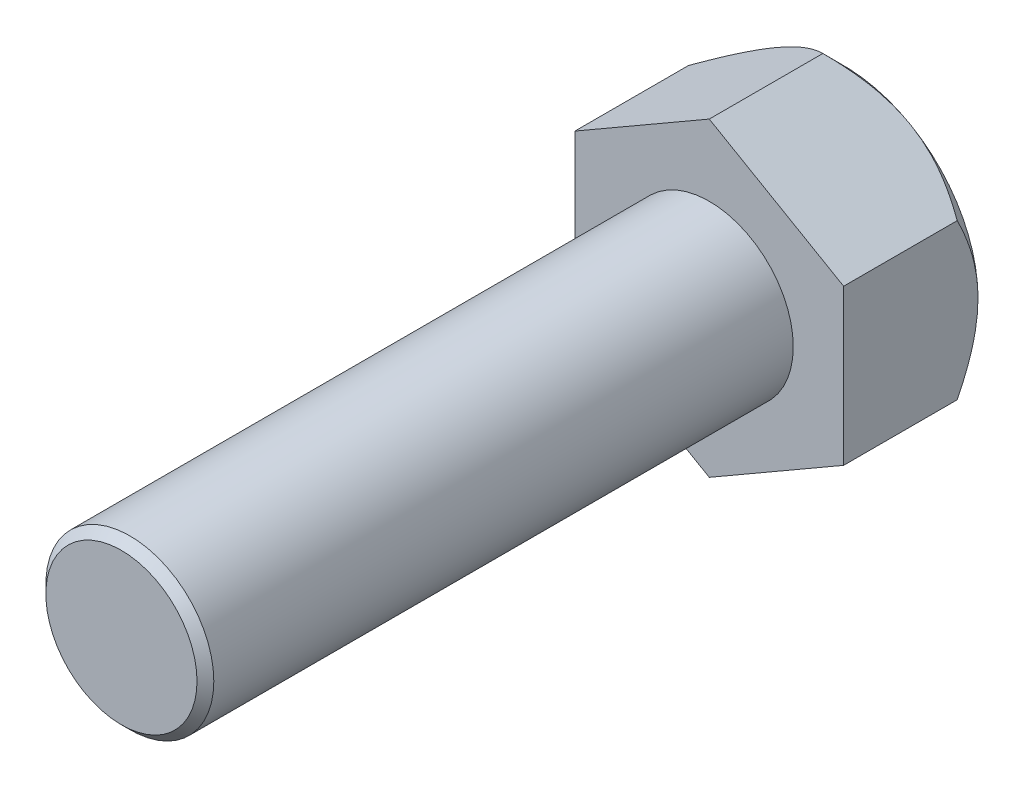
ISO-10303-21;
HEADER;
FILE_DESCRIPTION(('STEP AP214'),'2;1');
FILE_NAME('part.step','',(''),(''),'','','');
FILE_SCHEMA(('AUTOMOTIVE_DESIGN { 1 0 10303 214 1 1 1 1 }'));
ENDSEC;
DATA;
#1=APPLICATION_CONTEXT('core data for automotive mechanical design processes');
#2=APPLICATION_PROTOCOL_DEFINITION('international standard','automotive_design',2000,#1);
#3=PRODUCT_CONTEXT('',#1,'mechanical');
#4=PRODUCT('Part','Part','',(#3));
#5=PRODUCT_RELATED_PRODUCT_CATEGORY('part','',(#4));
#6=PRODUCT_DEFINITION_FORMATION('','',#4);
#7=PRODUCT_DEFINITION_CONTEXT('part definition',#1,'design');
#8=PRODUCT_DEFINITION('design','',#6,#7);
#9=PRODUCT_DEFINITION_SHAPE('','',#8);
#10=(LENGTH_UNIT() NAMED_UNIT(*) SI_UNIT(.MILLI.,.METRE.));
#11=(NAMED_UNIT(*) PLANE_ANGLE_UNIT() SI_UNIT($,.RADIAN.));
#12=(NAMED_UNIT(*) SI_UNIT($,.STERADIAN.) SOLID_ANGLE_UNIT());
#13=UNCERTAINTY_MEASURE_WITH_UNIT(LENGTH_MEASURE(1.E-05),#10,'distance_accuracy_value','');
#14=(GEOMETRIC_REPRESENTATION_CONTEXT(3) GLOBAL_UNCERTAINTY_ASSIGNED_CONTEXT((#13)) GLOBAL_UNIT_ASSIGNED_CONTEXT((#10,
#11,#12)) REPRESENTATION_CONTEXT('',''));
#15=CARTESIAN_POINT('',(0.,0.,0.));
#16=DIRECTION('',(0.,0.,1.));
#17=DIRECTION('',(1.,0.,0.));
#18=AXIS2_PLACEMENT_3D('',#15,#16,#17);
#19=CARTESIAN_POINT('',(0.,9.23760430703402,-8.));
#20=DIRECTION('',(-0.5,-0.866025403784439,0.));
#21=DIRECTION('',(0.866025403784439,-0.5,0.));
#22=AXIS2_PLACEMENT_3D('',#19,#20,#21);
#23=PLANE('',#22);
#24=CARTESIAN_POINT('',(-0.000200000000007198,9.23771977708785,-6.76228022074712));
#25=CARTESIAN_POINT('',(0.137352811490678,9.15830362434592,-6.84168743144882));
#26=CARTESIAN_POINT('',(0.2759629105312,9.07827704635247,-6.91865771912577));
#27=CARTESIAN_POINT('',(0.555505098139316,8.91688328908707,-7.06698316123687));
#28=CARTESIAN_POINT('',(0.696438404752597,8.83551540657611,-7.13833524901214));
#29=CARTESIAN_POINT('',(1.12434348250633,8.58846429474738,-7.3434607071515));
#30=CARTESIAN_POINT('',(1.41493761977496,8.42068969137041,-7.46742824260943));
#31=CARTESIAN_POINT('',(2.00094388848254,8.08235881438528,-7.6797139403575));
#32=CARTESIAN_POINT('',(2.29620625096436,7.91188900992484,-7.76856690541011));
#33=CARTESIAN_POINT('',(2.74395385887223,7.65338180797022,-7.87134783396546));
#34=CARTESIAN_POINT('',(2.89386225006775,7.5668321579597,-7.90051131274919));
#35=CARTESIAN_POINT('',(3.19494827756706,7.39300005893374,-7.94801217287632));
#36=CARTESIAN_POINT('',(3.34612572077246,7.3057177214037,-7.96635117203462));
#37=CARTESIAN_POINT('',(3.71452735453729,7.09302093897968,-7.99709931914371));
#38=CARTESIAN_POINT('',(3.93214848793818,6.96737731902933,-8.00355065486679));
#39=CARTESIAN_POINT('',(4.36699849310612,6.7163165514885,-7.99272107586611));
#40=CARTESIAN_POINT('',(4.5842272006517,6.59089949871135,-7.97543184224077));
#41=CARTESIAN_POINT('',(5.01663658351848,6.34124782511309,-7.91814025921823));
#42=CARTESIAN_POINT('',(5.23181469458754,6.21701468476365,-7.87811251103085));
#43=CARTESIAN_POINT('',(5.65847251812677,5.97068367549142,-7.77752005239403));
#44=CARTESIAN_POINT('',(5.8699525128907,5.84858564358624,-7.71695691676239));
#45=CARTESIAN_POINT('',(6.24536139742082,5.63184322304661,-7.5923620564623));
#46=CARTESIAN_POINT('',(6.41012167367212,5.53671883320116,-7.53160757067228));
#47=CARTESIAN_POINT('',(6.73668469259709,5.34817758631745,-7.40030853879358));
#48=CARTESIAN_POINT('',(6.89848734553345,5.25476078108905,-7.32976369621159));
#49=CARTESIAN_POINT('',(7.21862548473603,5.06992894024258,-7.18046522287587));
#50=CARTESIAN_POINT('',(7.37697007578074,4.97850864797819,-7.10173740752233));
#51=CARTESIAN_POINT('',(7.69072726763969,4.79736084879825,-6.93710651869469));
#52=CARTESIAN_POINT('',(7.84614159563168,4.70763234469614,-6.85120784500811));
#53=CARTESIAN_POINT('',(8.0002,4.61868668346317,-6.76228022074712));
#54=B_SPLINE_CURVE_WITH_KNOTS('',3,(#24,#25,#26,#27,#28,#29,#30,#31,#32,#33,#34,#35,#36,#37,#38,
#39,#40,#41,#42,#43,#44,#45,#46,#47,#48,#49,#50,#51,#52,#53),.UNSPECIFIED.,.F.,.F.,(4,2,2,2,2,2,
2,2,2,2,2,2,2,2,4),(0.,0.532696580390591,1.06568194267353,2.13740664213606,3.19211397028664,
3.71843331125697,4.244673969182,4.99761238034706,5.75081469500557,6.50485999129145,
7.25884747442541,7.85770857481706,8.4565878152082,9.05363199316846,9.65031250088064),.UNSPECIFIED.);
#55=CARTESIAN_POINT('',(0.,9.23760430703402,-6.762395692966));
#56=VERTEX_POINT('',#55);
#57=CARTESIAN_POINT('',(4.,6.92820323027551,-8.));
#58=VERTEX_POINT('',#57);
#59=EDGE_CURVE('E123',#56,#58,#54,.T.);
#60=ORIENTED_EDGE('',*,*,#59,.F.);
#61=DIRECTION('',(0.,0.,1.));
#62=VECTOR('',#61,1.);
#63=CARTESIAN_POINT('',(0.,9.23760430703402,-8.));
#64=LINE('',#63,#62);
#65=CARTESIAN_POINT('',(0.,9.23760430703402,0.));
#66=VERTEX_POINT('',#65);
#67=EDGE_CURVE('E272',#56,#66,#64,.T.);
#68=ORIENTED_EDGE('',*,*,#67,.T.);
#69=DIRECTION('',(0.866025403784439,-0.5,0.));
#70=VECTOR('',#69,1.);
#71=CARTESIAN_POINT('',(0.,9.23760430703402,0.));
#72=LINE('',#71,#70);
#73=CARTESIAN_POINT('',(8.,4.61880215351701,0.));
#74=VERTEX_POINT('',#73);
#75=EDGE_CURVE('E131',#66,#74,#72,.T.);
#76=ORIENTED_EDGE('',*,*,#75,.T.);
#77=DIRECTION('',(0.,0.,1.));
#78=VECTOR('',#77,1.);
#79=CARTESIAN_POINT('',(8.,4.61880215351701,-8.));
#80=LINE('',#79,#78);
#81=CARTESIAN_POINT('',(8.,4.61880215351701,-6.762395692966));
#82=VERTEX_POINT('',#81);
#83=EDGE_CURVE('E146',#82,#74,#80,.T.);
#84=ORIENTED_EDGE('',*,*,#83,.F.);
#85=EDGE_CURVE('E132',#58,#82,#54,.T.);
#86=ORIENTED_EDGE('',*,*,#85,.F.);
#87=EDGE_LOOP('',(#60,#68,#76,#84,#86));
#88=FACE_BOUND('',#87,.T.);
#89=ADVANCED_FACE('F52',(#88),#23,.F.);
#90=CARTESIAN_POINT('',(8.,4.61880215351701,-8.));
#91=DIRECTION('',(-1.,0.,0.));
#92=DIRECTION('',(0.,0.,1.));
#93=AXIS2_PLACEMENT_3D('',#90,#91,#92);
#94=PLANE('',#93);
#95=CARTESIAN_POINT('',(8.,16.8392040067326,2.64292872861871));
#96=CARTESIAN_POINT('',(8.,16.593620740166,2.42110954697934));
#97=CARTESIAN_POINT('',(8.,16.3475977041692,2.1997781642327));
#98=CARTESIAN_POINT('',(8.,15.8545518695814,1.75823119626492));
#99=CARTESIAN_POINT('',(8.,15.6075290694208,1.53801561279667));
#100=CARTESIAN_POINT('',(8.,14.8646370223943,0.879125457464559));
#101=CARTESIAN_POINT('',(8.,14.3670876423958,0.442337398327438));
#102=CARTESIAN_POINT('',(8.,13.614027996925,-0.20994229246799));
#103=CARTESIAN_POINT('',(8.,13.3606647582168,-0.427914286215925));
#104=CARTESIAN_POINT('',(8.,12.8522530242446,-0.861874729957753));
#105=CARTESIAN_POINT('',(8.,12.597204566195,-1.07786322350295));
#106=CARTESIAN_POINT('',(8.,12.0852111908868,-1.5074865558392));
#107=CARTESIAN_POINT('',(8.,11.8282666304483,-1.72112181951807));
#108=CARTESIAN_POINT('',(8.,11.3121071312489,-2.1456789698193));
#109=CARTESIAN_POINT('',(8.,11.0528920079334,-2.35660063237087));
#110=CARTESIAN_POINT('',(8.,10.5593897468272,-2.75305812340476));
#111=CARTESIAN_POINT('',(8.,10.3253648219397,-2.93892005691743));
#112=CARTESIAN_POINT('',(8.,9.85490632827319,-3.30756865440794));
#113=CARTESIAN_POINT('',(8.,9.61847278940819,-3.49035535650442));
#114=CARTESIAN_POINT('',(8.,9.14284387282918,-3.8522521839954));
#115=CARTESIAN_POINT('',(8.,8.90364879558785,-4.03136270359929));
#116=CARTESIAN_POINT('',(8.,8.42203323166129,-4.38518424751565));
#117=CARTESIAN_POINT('',(8.,8.17961286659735,-4.55989543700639));
#118=CARTESIAN_POINT('',(8.,7.69149325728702,-4.90364500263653));
#119=CARTESIAN_POINT('',(8.,7.44580149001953,-5.07269396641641));
#120=CARTESIAN_POINT('',(8.,6.95003627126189,-5.40429172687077));
#121=CARTESIAN_POINT('',(8.,6.69996260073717,-5.56684019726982));
#122=CARTESIAN_POINT('',(8.,6.1949159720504,-5.8837585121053));
#123=CARTESIAN_POINT('',(8.,5.93994670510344,-6.03813421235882));
#124=CARTESIAN_POINT('',(8.,5.42418038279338,-6.33679548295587));
#125=CARTESIAN_POINT('',(8.,5.1633842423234,-6.48108262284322));
#126=CARTESIAN_POINT('',(8.,4.64996978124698,-6.74921424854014));
#127=CARTESIAN_POINT('',(8.,4.39771588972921,-6.87375195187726));
#128=CARTESIAN_POINT('',(8.,3.88664476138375,-7.10873902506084));
#129=CARTESIAN_POINT('',(8.,3.62782705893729,-7.21918739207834));
#130=CARTESIAN_POINT('',(8.,3.10388100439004,-7.42235953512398));
#131=CARTESIAN_POINT('',(8.,2.83876719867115,-7.51512040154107));
#132=CARTESIAN_POINT('',(8.,2.3020340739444,-7.67929012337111));
#133=CARTESIAN_POINT('',(8.,2.03041803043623,-7.75070949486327));
#134=CARTESIAN_POINT('',(8.,1.52615278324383,-7.85882639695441));
#135=CARTESIAN_POINT('',(8.,1.29431217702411,-7.89927286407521));
#136=CARTESIAN_POINT('',(8.,0.82804924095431,-7.96057788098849));
#137=CARTESIAN_POINT('',(8.,0.593627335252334,-7.98143960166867));
#138=CARTESIAN_POINT('',(8.,0.124222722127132,-8.00246510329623));
#139=CARTESIAN_POINT('',(8.,-0.110758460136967,-8.00266238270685));
#140=CARTESIAN_POINT('',(8.,-0.57984058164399,-7.98244058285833));
#141=CARTESIAN_POINT('',(8.,-0.81394139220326,-7.96201859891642));
#142=CARTESIAN_POINT('',(8.,-1.33386345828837,-7.89455555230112));
#143=CARTESIAN_POINT('',(8.,-1.61902528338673,-7.84242057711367));
#144=CARTESIAN_POINT('',(8.,-2.18326759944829,-7.71198940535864));
#145=CARTESIAN_POINT('',(8.,-2.46234570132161,-7.63368312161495));
#146=CARTESIAN_POINT('',(8.,-3.01486157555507,-7.45478835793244));
#147=CARTESIAN_POINT('',(8.,-3.28826036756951,-7.35408088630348));
#148=CARTESIAN_POINT('',(8.,-3.69279521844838,-7.1896898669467));
#149=CARTESIAN_POINT('',(8.,-3.82670514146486,-7.13267501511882));
#150=CARTESIAN_POINT('',(8.,-4.09275215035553,-7.01465561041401));
#151=CARTESIAN_POINT('',(8.,-4.22488929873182,-6.95365119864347));
#152=CARTESIAN_POINT('',(8.,-4.61889822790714,-6.76523314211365));
#153=CARTESIAN_POINT('',(8.,-4.87822045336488,-6.63247544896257));
#154=CARTESIAN_POINT('',(8.,-5.39077542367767,-6.35562626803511));
#155=CARTESIAN_POINT('',(8.,-5.64400634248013,-6.21153143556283));
#156=CARTESIAN_POINT('',(8.,-6.14536079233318,-5.91413392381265));
#157=CARTESIAN_POINT('',(8.,-6.39347831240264,-5.76082115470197));
#158=CARTESIAN_POINT('',(8.,-6.88500953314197,-5.4469149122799));
#159=CARTESIAN_POINT('',(8.,-7.12842367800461,-5.28632213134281));
#160=CARTESIAN_POINT('',(8.,-7.61217081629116,-4.95856064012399));
#161=CARTESIAN_POINT('',(8.,-7.85248790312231,-4.79136852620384));
#162=CARTESIAN_POINT('',(8.,-8.32962833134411,-4.45207448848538));
#163=CARTESIAN_POINT('',(8.,-8.56645160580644,-4.27997247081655));
#164=CARTESIAN_POINT('',(8.,-9.03694389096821,-3.93180496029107));
#165=CARTESIAN_POINT('',(8.,-9.2706146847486,-3.75574187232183));
#166=CARTESIAN_POINT('',(8.,-9.73535278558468,-3.40020854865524));
#167=CARTESIAN_POINT('',(8.,-9.9664200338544,-3.22073823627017));
#168=CARTESIAN_POINT('',(8.,-10.6588482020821,-2.675990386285));
#169=CARTESIAN_POINT('',(8.,-11.1167833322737,-2.30635743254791));
#170=CARTESIAN_POINT('',(8.,-12.0257654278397,-1.55865432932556));
#171=CARTESIAN_POINT('',(8.,-12.476811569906,-1.18058318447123));
#172=CARTESIAN_POINT('',(8.,-13.3726557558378,-0.418841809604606));
#173=CARTESIAN_POINT('',(8.,-13.8174640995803,-0.0351836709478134));
#174=CARTESIAN_POINT('',(8.,-14.7028242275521,0.736970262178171));
#175=CARTESIAN_POINT('',(8.,-15.1433761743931,1.12546587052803));
#176=CARTESIAN_POINT('',(8.,-15.7927883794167,1.70319064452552));
#177=CARTESIAN_POINT('',(8.,-16.0029594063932,1.89094967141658));
#178=CARTESIAN_POINT('',(8.,-16.4219260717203,2.26666637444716));
#179=CARTESIAN_POINT('',(8.,-16.6307239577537,2.45462154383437));
#180=CARTESIAN_POINT('',(8.,-16.8392040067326,2.64292872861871));
#181=B_SPLINE_CURVE_WITH_KNOTS('',3,(#95,#96,#97,#98,#99,#100,#101,#102,#103,#104,#105,#106,
#107,#108,#109,#110,#111,#112,#113,#114,#115,#116,#117,#118,#119,#120,#121,#122,#123,#124,#125,
#126,#127,#128,#129,#130,#131,#132,#133,#134,#135,#136,#137,#138,#139,#140,#141,#142,#143,#144,
#145,#146,#147,#148,#149,#150,#151,#152,#153,#154,#155,#156,#157,#158,#159,#160,#161,#162,#163,
#164,#165,#166,#167,#168,#169,#170,#171,#172,#173,#174,#175,#176,#177,#178,#179,#180),
.UNSPECIFIED.,.F.,.F.,(4,2,2,2,2,2,2,2,2,2,2,2,2,2,2,2,2,2,2,2,2,2,2,2,2,2,2,2,2,2,2,2,2,2,2,2,
2,2,2,2,2,2,4),(0.,0.992788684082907,1.98557892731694,3.97174014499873,4.97440007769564,
5.97703794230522,6.97949170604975,7.98202772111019,8.87856136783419,9.77508389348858,
10.6715097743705,11.5679019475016,12.4625119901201,13.3571668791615,14.251171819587,
15.1450373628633,15.988654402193,16.8323314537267,17.6742193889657,18.515691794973,
19.2209670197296,19.9261280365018,20.6301459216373,21.3342629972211,22.2024540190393,
23.070980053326,23.9442346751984,24.3808100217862,24.817369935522,25.690966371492,
26.5648215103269,27.4396512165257,28.3143978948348,29.1925890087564,30.0707969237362,
30.9484853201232,31.8261934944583,33.5915387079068,35.357093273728,37.1192711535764,
38.8813814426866,39.7268547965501,40.5696539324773),.UNSPECIFIED.);
#182=CARTESIAN_POINT('',(8.00000000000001,0.,-8.));
#183=VERTEX_POINT('',#182);
#184=EDGE_CURVE('E138',#82,#183,#181,.T.);
#185=ORIENTED_EDGE('',*,*,#184,.F.);
#186=ORIENTED_EDGE('',*,*,#83,.T.);
#187=DIRECTION('',(0.,-1.,0.));
#188=VECTOR('',#187,1.);
#189=CARTESIAN_POINT('',(8.,4.61880215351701,0.));
#190=LINE('',#189,#188);
#191=CARTESIAN_POINT('',(8.,-4.61880215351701,0.));
#192=VERTEX_POINT('',#191);
#193=EDGE_CURVE('E283',#74,#192,#190,.T.);
#194=ORIENTED_EDGE('',*,*,#193,.T.);
#195=DIRECTION('',(0.,0.,1.));
#196=VECTOR('',#195,1.);
#197=CARTESIAN_POINT('',(8.,-4.61880215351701,-8.));
#198=LINE('',#197,#196);
#199=CARTESIAN_POINT('',(8.,-4.61880215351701,-6.762395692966));
#200=VERTEX_POINT('',#199);
#201=EDGE_CURVE('E220',#200,#192,#198,.T.);
#202=ORIENTED_EDGE('',*,*,#201,.F.);
#203=EDGE_CURVE('E147',#183,#200,#181,.T.);
#204=ORIENTED_EDGE('',*,*,#203,.F.);
#205=EDGE_LOOP('',(#185,#186,#194,#202,#204));
#206=FACE_BOUND('',#205,.T.);
#207=ADVANCED_FACE('F208',(#206),#94,.F.);
#208=CARTESIAN_POINT('',(8.,-4.61880215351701,-8.));
#209=DIRECTION('',(-0.5,0.866025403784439,0.));
#210=DIRECTION('',(-0.866025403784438,-0.5,0.));
#211=AXIS2_PLACEMENT_3D('',#208,#209,#210);
#212=PLANE('',#211);
#213=CARTESIAN_POINT('',(8.0002,-4.61868668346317,-6.76228022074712));
#214=CARTESIAN_POINT('',(7.86264718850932,-4.6981028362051,-6.84168743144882));
#215=CARTESIAN_POINT('',(7.7240370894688,-4.77812941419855,-6.91865771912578));
#216=CARTESIAN_POINT('',(7.44449490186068,-4.93952317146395,-7.06698316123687));
#217=CARTESIAN_POINT('',(7.3035615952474,-5.02089105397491,-7.13833524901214));
#218=CARTESIAN_POINT('',(6.87565651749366,-5.26794216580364,-7.3434607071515));
#219=CARTESIAN_POINT('',(6.58506238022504,-5.43571676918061,-7.46742824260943));
#220=CARTESIAN_POINT('',(5.99905611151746,-5.77404764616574,-7.6797139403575));
#221=CARTESIAN_POINT('',(5.70379374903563,-5.94451745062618,-7.76856690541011));
#222=CARTESIAN_POINT('',(5.25604614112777,-6.2030246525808,-7.87134783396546));
#223=CARTESIAN_POINT('',(5.10613774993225,-6.28957430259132,-7.90051131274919));
#224=CARTESIAN_POINT('',(4.80505172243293,-6.46340640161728,-7.94801217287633));
#225=CARTESIAN_POINT('',(4.65387427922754,-6.55068873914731,-7.96635117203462));
#226=CARTESIAN_POINT('',(4.2854726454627,-6.76338552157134,-7.99709931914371));
#227=CARTESIAN_POINT('',(4.06785151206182,-6.88902914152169,-8.00355065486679));
#228=CARTESIAN_POINT('',(3.63300150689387,-7.14008990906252,-7.9927210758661));
#229=CARTESIAN_POINT('',(3.4157727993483,-7.26550696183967,-7.97543184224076));
#230=CARTESIAN_POINT('',(2.98336341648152,-7.51515863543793,-7.91814025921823));
#231=CARTESIAN_POINT('',(2.76818530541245,-7.63939177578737,-7.87811251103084));
#232=CARTESIAN_POINT('',(2.34152748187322,-7.8857227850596,-7.77752005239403));
#233=CARTESIAN_POINT('',(2.13004748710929,-8.00782081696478,-7.71695691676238));
#234=CARTESIAN_POINT('',(1.75463860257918,-8.22456323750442,-7.5923620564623));
#235=CARTESIAN_POINT('',(1.58987832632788,-8.31968762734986,-7.53160757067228));
#236=CARTESIAN_POINT('',(1.26331530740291,-8.50822887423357,-7.40030853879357));
#237=CARTESIAN_POINT('',(1.10151265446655,-8.60164567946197,-7.32976369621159));
#238=CARTESIAN_POINT('',(0.781374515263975,-8.78647752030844,-7.18046522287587));
#239=CARTESIAN_POINT('',(0.623029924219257,-8.87789781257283,-7.10173740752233));
#240=CARTESIAN_POINT('',(0.309272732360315,-9.05904561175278,-6.93710651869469));
#241=CARTESIAN_POINT('',(0.153858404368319,-9.14877411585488,-6.85120784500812));
#242=CARTESIAN_POINT('',(-0.000199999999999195,-9.23771977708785,-6.76228022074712));
#243=B_SPLINE_CURVE_WITH_KNOTS('',3,(#213,#214,#215,#216,#217,#218,#219,#220,#221,#222,#223,
#224,#225,#226,#227,#228,#229,#230,#231,#232,#233,#234,#235,#236,#237,#238,#239,#240,#241,#242),
.UNSPECIFIED.,.F.,.F.,(4,2,2,2,2,2,2,2,2,2,2,2,2,2,4),(0.,0.53269658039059,1.06568194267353,
2.13740664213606,3.19211397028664,3.71843331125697,4.244673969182,4.99761238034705,
5.75081469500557,6.50485999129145,7.2588474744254,7.85770857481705,8.4565878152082,
9.05363199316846,9.65031250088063),.UNSPECIFIED.);
#244=CARTESIAN_POINT('',(4.,-6.92820323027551,-8.));
#245=VERTEX_POINT('',#244);
#246=EDGE_CURVE('E202',#200,#245,#243,.T.);
#247=ORIENTED_EDGE('',*,*,#246,.F.);
#248=ORIENTED_EDGE('',*,*,#201,.T.);
#249=DIRECTION('',(-0.866025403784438,-0.5,0.));
#250=VECTOR('',#249,1.);
#251=CARTESIAN_POINT('',(8.,-4.61880215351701,0.));
#252=LINE('',#251,#250);
#253=CARTESIAN_POINT('',(0.,-9.23760430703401,0.));
#254=VERTEX_POINT('',#253);
#255=EDGE_CURVE('E237',#192,#254,#252,.T.);
#256=ORIENTED_EDGE('',*,*,#255,.T.);
#257=DIRECTION('',(0.,0.,1.));
#258=VECTOR('',#257,1.);
#259=CARTESIAN_POINT('',(0.,-9.23760430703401,-8.));
#260=LINE('',#259,#258);
#261=CARTESIAN_POINT('',(0.,-9.23760430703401,-6.762395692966));
#262=VERTEX_POINT('',#261);
#263=EDGE_CURVE('E235',#262,#254,#260,.T.);
#264=ORIENTED_EDGE('',*,*,#263,.F.);
#265=EDGE_CURVE('E196',#245,#262,#243,.T.);
#266=ORIENTED_EDGE('',*,*,#265,.F.);
#267=EDGE_LOOP('',(#247,#248,#256,#264,#266));
#268=FACE_BOUND('',#267,.T.);
#269=ADVANCED_FACE('F204',(#268),#212,.F.);
#270=CARTESIAN_POINT('',(0.,-9.23760430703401,-8.));
#271=DIRECTION('',(0.5,0.866025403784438,0.));
#272=DIRECTION('',(-0.866025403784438,0.5,0.));
#273=AXIS2_PLACEMENT_3D('',#270,#271,#272);
#274=PLANE('',#273);
#275=CARTESIAN_POINT('',(0.000200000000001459,-9.23771977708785,-6.76228022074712));
#276=CARTESIAN_POINT('',(-0.137352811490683,-9.15830362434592,-6.84168743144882));
#277=CARTESIAN_POINT('',(-0.275962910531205,-9.07827704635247,-6.91865771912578));
#278=CARTESIAN_POINT('',(-0.555505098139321,-8.91688328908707,-7.06698316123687));
#279=CARTESIAN_POINT('',(-0.696438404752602,-8.8355154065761,-7.13833524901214));
#280=CARTESIAN_POINT('',(-1.12434348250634,-8.58846429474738,-7.3434607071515));
#281=CARTESIAN_POINT('',(-1.41493761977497,-8.42068969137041,-7.46742824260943));
#282=CARTESIAN_POINT('',(-2.00094388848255,-8.08235881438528,-7.6797139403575));
#283=CARTESIAN_POINT('',(-2.29620625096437,-7.91188900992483,-7.76856690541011));
#284=CARTESIAN_POINT('',(-2.74395385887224,-7.65338180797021,-7.87134783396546));
#285=CARTESIAN_POINT('',(-2.89386225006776,-7.56683215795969,-7.90051131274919));
#286=CARTESIAN_POINT('',(-3.19494827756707,-7.39300005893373,-7.94801217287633));
#287=CARTESIAN_POINT('',(-3.34612572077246,-7.3057177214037,-7.96635117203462));
#288=CARTESIAN_POINT('',(-3.7145273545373,-7.09302093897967,-7.99709931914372));
#289=CARTESIAN_POINT('',(-3.93214848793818,-6.96737731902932,-8.00355065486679));
#290=CARTESIAN_POINT('',(-4.36699849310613,-6.7163165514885,-7.99272107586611));
#291=CARTESIAN_POINT('',(-4.58422720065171,-6.59089949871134,-7.97543184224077));
#292=CARTESIAN_POINT('',(-5.01663658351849,-6.34124782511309,-7.91814025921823));
#293=CARTESIAN_POINT('',(-5.23181469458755,-6.21701468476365,-7.87811251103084));
#294=CARTESIAN_POINT('',(-5.65847251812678,-5.97068367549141,-7.77752005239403));
#295=CARTESIAN_POINT('',(-5.86995251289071,-5.84858564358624,-7.71695691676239));
#296=CARTESIAN_POINT('',(-6.24536139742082,-5.6318432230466,-7.5923620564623));
#297=CARTESIAN_POINT('',(-6.41012167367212,-5.53671883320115,-7.53160757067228));
#298=CARTESIAN_POINT('',(-6.73668469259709,-5.34817758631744,-7.40030853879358));
#299=CARTESIAN_POINT('',(-6.89848734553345,-5.25476078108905,-7.32976369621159));
#300=CARTESIAN_POINT('',(-7.21862548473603,-5.06992894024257,-7.18046522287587));
#301=CARTESIAN_POINT('',(-7.37697007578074,-4.97850864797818,-7.10173740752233));
#302=CARTESIAN_POINT('',(-7.69072726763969,-4.79736084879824,-6.93710651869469));
#303=CARTESIAN_POINT('',(-7.84614159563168,-4.70763234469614,-6.85120784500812));
#304=CARTESIAN_POINT('',(-8.0002,-4.61868668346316,-6.76228022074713));
#305=B_SPLINE_CURVE_WITH_KNOTS('',3,(#275,#276,#277,#278,#279,#280,#281,#282,#283,#284,#285,
#286,#287,#288,#289,#290,#291,#292,#293,#294,#295,#296,#297,#298,#299,#300,#301,#302,#303,#304),
.UNSPECIFIED.,.F.,.F.,(4,2,2,2,2,2,2,2,2,2,2,2,2,2,4),(0.,0.532696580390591,1.06568194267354,
2.13740664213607,3.19211397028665,3.71843331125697,4.24467396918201,4.99761238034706,
5.75081469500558,6.50485999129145,7.25884747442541,7.85770857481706,8.4565878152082,
9.05363199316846,9.65031250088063),.UNSPECIFIED.);
#306=CARTESIAN_POINT('',(-4.00000000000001,-6.92820323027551,-8.));
#307=VERTEX_POINT('',#306);
#308=EDGE_CURVE('E203',#262,#307,#305,.T.);
#309=ORIENTED_EDGE('',*,*,#308,.F.);
#310=ORIENTED_EDGE('',*,*,#263,.T.);
#311=DIRECTION('',(-0.866025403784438,0.5,0.));
#312=VECTOR('',#311,1.);
#313=CARTESIAN_POINT('',(0.,-9.23760430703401,0.));
#314=LINE('',#313,#312);
#315=CARTESIAN_POINT('',(-8.,-4.618802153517,0.));
#316=VERTEX_POINT('',#315);
#317=EDGE_CURVE('E281',#254,#316,#314,.T.);
#318=ORIENTED_EDGE('',*,*,#317,.T.);
#319=DIRECTION('',(0.,0.,1.));
#320=VECTOR('',#319,1.);
#321=CARTESIAN_POINT('',(-8.,-4.618802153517,-8.));
#322=LINE('',#321,#320);
#323=CARTESIAN_POINT('',(-8.,-4.618802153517,-6.762395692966));
#324=VERTEX_POINT('',#323);
#325=EDGE_CURVE('E241',#324,#316,#322,.T.);
#326=ORIENTED_EDGE('',*,*,#325,.F.);
#327=EDGE_CURVE('E190',#307,#324,#305,.T.);
#328=ORIENTED_EDGE('',*,*,#327,.F.);
#329=EDGE_LOOP('',(#309,#310,#318,#326,#328));
#330=FACE_BOUND('',#329,.T.);
#331=ADVANCED_FACE('F207',(#330),#274,.F.);
#332=CARTESIAN_POINT('',(-8.,-4.618802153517,-8.));
#333=DIRECTION('',(1.,0.,0.));
#334=DIRECTION('',(0.,0.,-1.));
#335=AXIS2_PLACEMENT_3D('',#332,#333,#334);
#336=PLANE('',#335);
#337=CARTESIAN_POINT('',(-8.,-16.8392040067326,2.64292872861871));
#338=CARTESIAN_POINT('',(-8.,-16.5936207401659,2.42110954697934));
#339=CARTESIAN_POINT('',(-8.,-16.3475977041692,2.19977816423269));
#340=CARTESIAN_POINT('',(-8.,-15.8545518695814,1.75823119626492));
#341=CARTESIAN_POINT('',(-8.,-15.6075290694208,1.53801561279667));
#342=CARTESIAN_POINT('',(-8.,-14.8646370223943,0.879125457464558));
#343=CARTESIAN_POINT('',(-8.,-14.3670876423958,0.442337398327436));
#344=CARTESIAN_POINT('',(-8.,-13.614027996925,-0.209942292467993));
#345=CARTESIAN_POINT('',(-8.,-13.3606647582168,-0.427914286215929));
#346=CARTESIAN_POINT('',(-8.,-12.8522530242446,-0.861874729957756));
#347=CARTESIAN_POINT('',(-8.,-12.597204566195,-1.07786322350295));
#348=CARTESIAN_POINT('',(-8.,-12.0852111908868,-1.5074865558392));
#349=CARTESIAN_POINT('',(-8.,-11.8282666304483,-1.72112181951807));
#350=CARTESIAN_POINT('',(-8.,-11.3121071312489,-2.1456789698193));
#351=CARTESIAN_POINT('',(-8.,-11.0528920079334,-2.35660063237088));
#352=CARTESIAN_POINT('',(-8.,-10.5593897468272,-2.75305812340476));
#353=CARTESIAN_POINT('',(-8.,-10.3253648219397,-2.93892005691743));
#354=CARTESIAN_POINT('',(-8.,-9.85490632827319,-3.30756865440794));
#355=CARTESIAN_POINT('',(-8.,-9.61847278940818,-3.49035535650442));
#356=CARTESIAN_POINT('',(-8.,-9.14284387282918,-3.8522521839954));
#357=CARTESIAN_POINT('',(-8.,-8.90364879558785,-4.03136270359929));
#358=CARTESIAN_POINT('',(-8.,-8.42203323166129,-4.38518424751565));
#359=CARTESIAN_POINT('',(-8.,-8.17961286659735,-4.55989543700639));
#360=CARTESIAN_POINT('',(-8.,-7.69149325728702,-4.90364500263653));
#361=CARTESIAN_POINT('',(-8.,-7.44580149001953,-5.07269396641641));
#362=CARTESIAN_POINT('',(-8.,-6.95003627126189,-5.40429172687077));
#363=CARTESIAN_POINT('',(-8.,-6.69996260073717,-5.56684019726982));
#364=CARTESIAN_POINT('',(-8.,-6.1949159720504,-5.8837585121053));
#365=CARTESIAN_POINT('',(-8.,-5.93994670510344,-6.03813421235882));
#366=CARTESIAN_POINT('',(-8.,-5.42418038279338,-6.33679548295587));
#367=CARTESIAN_POINT('',(-8.,-5.1633842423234,-6.48108262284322));
#368=CARTESIAN_POINT('',(-8.,-4.64996978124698,-6.74921424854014));
#369=CARTESIAN_POINT('',(-8.,-4.39771588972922,-6.87375195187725));
#370=CARTESIAN_POINT('',(-8.,-3.88664476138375,-7.10873902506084));
#371=CARTESIAN_POINT('',(-8.,-3.62782705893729,-7.21918739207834));
#372=CARTESIAN_POINT('',(-8.,-3.10388100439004,-7.42235953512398));
#373=CARTESIAN_POINT('',(-8.,-2.83876719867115,-7.51512040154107));
#374=CARTESIAN_POINT('',(-8.,-2.3020340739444,-7.67929012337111));
#375=CARTESIAN_POINT('',(-8.,-2.03041803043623,-7.75070949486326));
#376=CARTESIAN_POINT('',(-8.,-1.52615278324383,-7.85882639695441));
#377=CARTESIAN_POINT('',(-8.,-1.29431217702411,-7.89927286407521));
#378=CARTESIAN_POINT('',(-8.,-0.82804924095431,-7.96057788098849));
#379=CARTESIAN_POINT('',(-8.,-0.593627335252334,-7.98143960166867));
#380=CARTESIAN_POINT('',(-8.,-0.124222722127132,-8.00246510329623));
#381=CARTESIAN_POINT('',(-8.,0.110758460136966,-8.00266238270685));
#382=CARTESIAN_POINT('',(-8.,0.579840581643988,-7.98244058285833));
#383=CARTESIAN_POINT('',(-8.,0.813941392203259,-7.96201859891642));
#384=CARTESIAN_POINT('',(-8.,1.33386345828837,-7.89455555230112));
#385=CARTESIAN_POINT('',(-8.,1.61902528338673,-7.84242057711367));
#386=CARTESIAN_POINT('',(-8.,2.18326759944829,-7.71198940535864));
#387=CARTESIAN_POINT('',(-8.,2.46234570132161,-7.63368312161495));
#388=CARTESIAN_POINT('',(-8.,3.01486157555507,-7.45478835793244));
#389=CARTESIAN_POINT('',(-8.,3.2882603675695,-7.35408088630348));
#390=CARTESIAN_POINT('',(-8.,3.69279521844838,-7.1896898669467));
#391=CARTESIAN_POINT('',(-8.,3.82670514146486,-7.13267501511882));
#392=CARTESIAN_POINT('',(-8.,4.09275215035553,-7.01465561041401));
#393=CARTESIAN_POINT('',(-8.,4.22488929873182,-6.95365119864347));
#394=CARTESIAN_POINT('',(-8.,4.61889822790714,-6.76523314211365));
#395=CARTESIAN_POINT('',(-8.,4.87822045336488,-6.63247544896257));
#396=CARTESIAN_POINT('',(-8.,5.39077542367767,-6.35562626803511));
#397=CARTESIAN_POINT('',(-8.,5.64400634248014,-6.21153143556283));
#398=CARTESIAN_POINT('',(-8.,6.14536079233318,-5.91413392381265));
#399=CARTESIAN_POINT('',(-8.,6.39347831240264,-5.76082115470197));
#400=CARTESIAN_POINT('',(-8.,6.88500953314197,-5.4469149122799));
#401=CARTESIAN_POINT('',(-8.,7.12842367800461,-5.28632213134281));
#402=CARTESIAN_POINT('',(-8.,7.61217081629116,-4.95856064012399));
#403=CARTESIAN_POINT('',(-8.,7.85248790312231,-4.79136852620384));
#404=CARTESIAN_POINT('',(-8.,8.32962833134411,-4.45207448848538));
#405=CARTESIAN_POINT('',(-8.,8.56645160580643,-4.27997247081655));
#406=CARTESIAN_POINT('',(-8.,9.03694389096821,-3.93180496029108));
#407=CARTESIAN_POINT('',(-8.,9.27061468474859,-3.75574187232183));
#408=CARTESIAN_POINT('',(-8.,9.73535278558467,-3.40020854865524));
#409=CARTESIAN_POINT('',(-8.,9.96642003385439,-3.22073823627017));
#410=CARTESIAN_POINT('',(-8.,10.6588482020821,-2.67599038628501));
#411=CARTESIAN_POINT('',(-8.,11.1167833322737,-2.30635743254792));
#412=CARTESIAN_POINT('',(-8.,12.0257654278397,-1.55865432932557));
#413=CARTESIAN_POINT('',(-8.,12.476811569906,-1.18058318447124));
#414=CARTESIAN_POINT('',(-8.,13.3726557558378,-0.418841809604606));
#415=CARTESIAN_POINT('',(-8.,13.8174640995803,-0.035183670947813));
#416=CARTESIAN_POINT('',(-8.,14.7028242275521,0.73697026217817));
#417=CARTESIAN_POINT('',(-8.,15.1433761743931,1.12546587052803));
#418=CARTESIAN_POINT('',(-8.,15.7927883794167,1.70319064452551));
#419=CARTESIAN_POINT('',(-8.,16.0029594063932,1.89094967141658));
#420=CARTESIAN_POINT('',(-8.,16.4219260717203,2.26666637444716));
#421=CARTESIAN_POINT('',(-8.,16.6307239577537,2.45462154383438));
#422=CARTESIAN_POINT('',(-8.,16.8392040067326,2.64292872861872));
#423=B_SPLINE_CURVE_WITH_KNOTS('',3,(#337,#338,#339,#340,#341,#342,#343,#344,#345,#346,#347,
#348,#349,#350,#351,#352,#353,#354,#355,#356,#357,#358,#359,#360,#361,#362,#363,#364,#365,#366,
#367,#368,#369,#370,#371,#372,#373,#374,#375,#376,#377,#378,#379,#380,#381,#382,#383,#384,#385,
#386,#387,#388,#389,#390,#391,#392,#393,#394,#395,#396,#397,#398,#399,#400,#401,#402,#403,#404,
#405,#406,#407,#408,#409,#410,#411,#412,#413,#414,#415,#416,#417,#418,#419,#420,#421,#422),
.UNSPECIFIED.,.F.,.F.,(4,2,2,2,2,2,2,2,2,2,2,2,2,2,2,2,2,2,2,2,2,2,2,2,2,2,2,2,2,2,2,2,2,2,2,2,
2,2,2,2,2,2,4),(0.,0.992788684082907,1.98557892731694,3.97174014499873,4.97440007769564,
5.97703794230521,6.97949170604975,7.98202772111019,8.87856136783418,9.77508389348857,
10.6715097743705,11.5679019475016,12.4625119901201,13.3571668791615,14.251171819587,
15.1450373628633,15.988654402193,16.8323314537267,17.6742193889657,18.515691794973,
19.2209670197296,19.9261280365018,20.6301459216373,21.3342629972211,22.2024540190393,
23.070980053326,23.9442346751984,24.3808100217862,24.817369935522,25.690966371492,
26.5648215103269,27.4396512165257,28.3143978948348,29.1925890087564,30.0707969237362,
30.9484853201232,31.8261934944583,33.5915387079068,35.357093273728,37.1192711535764,
38.8813814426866,39.7268547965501,40.5696539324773),.UNSPECIFIED.);
#424=CARTESIAN_POINT('',(-8.00000000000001,0.,-8.));
#425=VERTEX_POINT('',#424);
#426=EDGE_CURVE('E264',#324,#425,#423,.T.);
#427=ORIENTED_EDGE('',*,*,#426,.F.);
#428=ORIENTED_EDGE('',*,*,#325,.T.);
#429=DIRECTION('',(0.,1.,0.));
#430=VECTOR('',#429,1.);
#431=CARTESIAN_POINT('',(-8.,-4.618802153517,0.));
#432=LINE('',#431,#430);
#433=CARTESIAN_POINT('',(-8.,4.61880215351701,0.));
#434=VERTEX_POINT('',#433);
#435=EDGE_CURVE('E277',#316,#434,#432,.T.);
#436=ORIENTED_EDGE('',*,*,#435,.T.);
#437=DIRECTION('',(0.,0.,1.));
#438=VECTOR('',#437,1.);
#439=CARTESIAN_POINT('',(-8.,4.61880215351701,-8.));
#440=LINE('',#439,#438);
#441=CARTESIAN_POINT('',(-8.,4.61880215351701,-6.762395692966));
#442=VERTEX_POINT('',#441);
#443=EDGE_CURVE('E244',#442,#434,#440,.T.);
#444=ORIENTED_EDGE('',*,*,#443,.F.);
#445=EDGE_CURVE('E183',#425,#442,#423,.T.);
#446=ORIENTED_EDGE('',*,*,#445,.F.);
#447=EDGE_LOOP('',(#427,#428,#436,#444,#446));
#448=FACE_BOUND('',#447,.T.);
#449=ADVANCED_FACE('F263',(#448),#336,.F.);
#450=CARTESIAN_POINT('',(-8.,4.61880215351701,-8.));
#451=DIRECTION('',(0.5,-0.866025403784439,0.));
#452=DIRECTION('',(0.866025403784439,0.5,0.));
#453=AXIS2_PLACEMENT_3D('',#450,#451,#452);
#454=PLANE('',#453);
#455=CARTESIAN_POINT('',(-8.0002,4.61868668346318,-6.76228022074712));
#456=CARTESIAN_POINT('',(-7.86264718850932,4.69810283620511,-6.84168743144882));
#457=CARTESIAN_POINT('',(-7.72403708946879,4.77812941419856,-6.91865771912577));
#458=CARTESIAN_POINT('',(-7.44449490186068,4.93952317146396,-7.06698316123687));
#459=CARTESIAN_POINT('',(-7.3035615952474,5.02089105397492,-7.13833524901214));
#460=CARTESIAN_POINT('',(-6.87565651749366,5.26794216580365,-7.3434607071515));
#461=CARTESIAN_POINT('',(-6.58506238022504,5.43571676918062,-7.46742824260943));
#462=CARTESIAN_POINT('',(-5.99905611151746,5.77404764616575,-7.67971394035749));
#463=CARTESIAN_POINT('',(-5.70379374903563,5.94451745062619,-7.7685669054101));
#464=CARTESIAN_POINT('',(-5.25604614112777,6.20302465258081,-7.87134783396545));
#465=CARTESIAN_POINT('',(-5.10613774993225,6.28957430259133,-7.90051131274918));
#466=CARTESIAN_POINT('',(-4.80505172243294,6.46340640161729,-7.94801217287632));
#467=CARTESIAN_POINT('',(-4.65387427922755,6.55068873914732,-7.96635117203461));
#468=CARTESIAN_POINT('',(-4.28547264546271,6.76338552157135,-7.99709931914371));
#469=CARTESIAN_POINT('',(-4.06785151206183,6.8890291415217,-8.00355065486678));
#470=CARTESIAN_POINT('',(-3.63300150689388,7.14008990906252,-7.9927210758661));
#471=CARTESIAN_POINT('',(-3.4157727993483,7.26550696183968,-7.97543184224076));
#472=CARTESIAN_POINT('',(-2.98336341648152,7.51515863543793,-7.91814025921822));
#473=CARTESIAN_POINT('',(-2.76818530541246,7.63939177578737,-7.87811251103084));
#474=CARTESIAN_POINT('',(-2.34152748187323,7.88572278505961,-7.77752005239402));
#475=CARTESIAN_POINT('',(-2.13004748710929,8.00782081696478,-7.71695691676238));
#476=CARTESIAN_POINT('',(-1.75463860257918,8.22456323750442,-7.59236205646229));
#477=CARTESIAN_POINT('',(-1.58987832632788,8.31968762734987,-7.53160757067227));
#478=CARTESIAN_POINT('',(-1.26331530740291,8.50822887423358,-7.40030853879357));
#479=CARTESIAN_POINT('',(-1.10151265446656,8.60164567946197,-7.32976369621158));
#480=CARTESIAN_POINT('',(-0.781374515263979,8.78647752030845,-7.18046522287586));
#481=CARTESIAN_POINT('',(-0.623029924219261,8.87789781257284,-7.10173740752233));
#482=CARTESIAN_POINT('',(-0.309272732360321,9.05904561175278,-6.93710651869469));
#483=CARTESIAN_POINT('',(-0.153858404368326,9.14877411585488,-6.85120784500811));
#484=CARTESIAN_POINT('',(0.000199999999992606,9.23771977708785,-6.76228022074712));
#485=B_SPLINE_CURVE_WITH_KNOTS('',3,(#455,#456,#457,#458,#459,#460,#461,#462,#463,#464,#465,
#466,#467,#468,#469,#470,#471,#472,#473,#474,#475,#476,#477,#478,#479,#480,#481,#482,#483,#484),
.UNSPECIFIED.,.F.,.F.,(4,2,2,2,2,2,2,2,2,2,2,2,2,2,4),(0.,0.532696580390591,1.06568194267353,
2.13740664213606,3.19211397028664,3.71843331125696,4.24467396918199,4.99761238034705,
5.75081469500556,6.50485999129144,7.2588474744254,7.85770857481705,8.45658781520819,
9.05363199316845,9.65031250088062),.UNSPECIFIED.);
#486=CARTESIAN_POINT('',(-4.,6.92820323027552,-8.));
#487=VERTEX_POINT('',#486);
#488=EDGE_CURVE('E268',#442,#487,#485,.T.);
#489=ORIENTED_EDGE('',*,*,#488,.F.);
#490=ORIENTED_EDGE('',*,*,#443,.T.);
#491=DIRECTION('',(0.866025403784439,0.5,0.));
#492=VECTOR('',#491,1.);
#493=CARTESIAN_POINT('',(-8.,4.61880215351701,0.));
#494=LINE('',#493,#492);
#495=EDGE_CURVE('E274',#434,#66,#494,.T.);
#496=ORIENTED_EDGE('',*,*,#495,.T.);
#497=ORIENTED_EDGE('',*,*,#67,.F.);
#498=EDGE_CURVE('E127',#487,#56,#485,.T.);
#499=ORIENTED_EDGE('',*,*,#498,.F.);
#500=EDGE_LOOP('',(#489,#490,#496,#497,#499));
#501=FACE_BOUND('',#500,.T.);
#502=ADVANCED_FACE('F270',(#501),#454,.F.);
#503=CARTESIAN_POINT('',(0.,0.,35.));
#504=DIRECTION('',(0.,0.,-1.));
#505=DIRECTION('',(-1.,0.,0.));
#506=AXIS2_PLACEMENT_3D('',#503,#504,#505);
#507=CYLINDRICAL_SURFACE('',#506,5.);
#508=CARTESIAN_POINT('',(0.,0.,34.5));
#509=DIRECTION('',(0.,0.,1.));
#510=DIRECTION('',(1.,0.,0.));
#511=AXIS2_PLACEMENT_3D('',#508,#509,#510);
#512=CIRCLE('',#511,5.);
#513=CARTESIAN_POINT('',(5.,0.,34.5));
#514=VERTEX_POINT('',#513);
#515=EDGE_CURVE('E254',#514,#514,#512,.F.);
#516=ORIENTED_EDGE('',*,*,#515,.T.);
#517=EDGE_LOOP('',(#516));
#518=FACE_BOUND('',#517,.T.);
#519=CARTESIAN_POINT('',(0.,0.,0.));
#520=DIRECTION('',(0.,0.,1.));
#521=DIRECTION('',(1.,0.,0.));
#522=AXIS2_PLACEMENT_3D('',#519,#520,#521);
#523=CIRCLE('',#522,5.);
#524=CARTESIAN_POINT('',(5.,0.,0.));
#525=VERTEX_POINT('',#524);
#526=EDGE_CURVE('E249',#525,#525,#523,.T.);
#527=ORIENTED_EDGE('',*,*,#526,.T.);
#528=EDGE_LOOP('',(#527));
#529=FACE_BOUND('',#528,.T.);
#530=ADVANCED_FACE('F315',(#518,#529),#507,.T.);
#531=CARTESIAN_POINT('',(0.,0.,35.));
#532=DIRECTION('',(0.,0.,1.));
#533=DIRECTION('',(1.,0.,0.));
#534=AXIS2_PLACEMENT_3D('',#531,#532,#533);
#535=PLANE('',#534);
#536=CARTESIAN_POINT('',(0.,0.,35.));
#537=DIRECTION('',(0.,0.,1.));
#538=DIRECTION('',(1.,0.,0.));
#539=AXIS2_PLACEMENT_3D('',#536,#537,#538);
#540=CIRCLE('',#539,4.5);
#541=CARTESIAN_POINT('',(4.5,0.,35.));
#542=VERTEX_POINT('',#541);
#543=EDGE_CURVE('E252',#542,#542,#540,.T.);
#544=ORIENTED_EDGE('',*,*,#543,.T.);
#545=EDGE_LOOP('',(#544));
#546=FACE_BOUND('',#545,.T.);
#547=ADVANCED_FACE('F386',(#546),#535,.T.);
#548=CARTESIAN_POINT('',(0.,0.,35.));
#549=DIRECTION('',(0.,0.,-1.));
#550=DIRECTION('',(-1.,0.,0.));
#551=AXIS2_PLACEMENT_3D('',#548,#549,#550);
#552=CONICAL_SURFACE('',#551,4.5,0.785398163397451);
#553=ORIENTED_EDGE('',*,*,#515,.F.);
#554=EDGE_LOOP('',(#553));
#555=FACE_BOUND('',#554,.T.);
#556=ORIENTED_EDGE('',*,*,#543,.F.);
#557=EDGE_LOOP('',(#556));
#558=FACE_BOUND('',#557,.T.);
#559=ADVANCED_FACE('F55',(#555,#558),#552,.T.);
#560=CARTESIAN_POINT('',(0.,0.,0.));
#561=DIRECTION('',(0.,0.,-1.));
#562=DIRECTION('',(-1.,0.,0.));
#563=AXIS2_PLACEMENT_3D('',#560,#561,#562);
#564=PLANE('',#563);
#565=ORIENTED_EDGE('',*,*,#526,.F.);
#566=EDGE_LOOP('',(#565));
#567=FACE_BOUND('',#566,.T.);
#568=ORIENTED_EDGE('',*,*,#75,.F.);
#569=ORIENTED_EDGE('',*,*,#495,.F.);
#570=ORIENTED_EDGE('',*,*,#435,.F.);
#571=ORIENTED_EDGE('',*,*,#317,.F.);
#572=ORIENTED_EDGE('',*,*,#255,.F.);
#573=ORIENTED_EDGE('',*,*,#193,.F.);
#574=EDGE_LOOP('',(#568,#569,#570,#571,#572,#573));
#575=FACE_BOUND('',#574,.T.);
#576=ADVANCED_FACE('F285',(#567,#575),#564,.F.);
#577=CARTESIAN_POINT('',(0.,0.,-8.));
#578=DIRECTION('',(0.,0.,1.));
#579=DIRECTION('',(-1.,0.,0.));
#580=AXIS2_PLACEMENT_3D('',#577,#578,#579);
#581=CONICAL_SURFACE('',#580,8.00000000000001,0.78539816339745);
#582=ORIENTED_EDGE('',*,*,#327,.T.);
#583=ORIENTED_EDGE('',*,*,#426,.T.);
#584=CARTESIAN_POINT('',(0.,0.,-8.));
#585=DIRECTION('',(0.,0.,-1.));
#586=DIRECTION('',(-1.,0.,0.));
#587=AXIS2_PLACEMENT_3D('',#584,#585,#586);
#588=CIRCLE('',#587,8.00000000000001);
#589=EDGE_CURVE('E57',#307,#425,#588,.T.);
#590=ORIENTED_EDGE('',*,*,#589,.F.);
#591=EDGE_LOOP('',(#582,#583,#590));
#592=FACE_BOUND('',#591,.T.);
#593=ADVANCED_FACE('F287',(#592),#581,.T.);
#594=ORIENTED_EDGE('',*,*,#265,.T.);
#595=ORIENTED_EDGE('',*,*,#308,.T.);
#596=EDGE_CURVE('E228',#245,#307,#588,.T.);
#597=ORIENTED_EDGE('',*,*,#596,.F.);
#598=EDGE_LOOP('',(#594,#595,#597));
#599=FACE_BOUND('',#598,.T.);
#600=ADVANCED_FACE('F229',(#599),#581,.T.);
#601=ORIENTED_EDGE('',*,*,#203,.T.);
#602=ORIENTED_EDGE('',*,*,#246,.T.);
#603=EDGE_CURVE('E142',#183,#245,#588,.T.);
#604=ORIENTED_EDGE('',*,*,#603,.F.);
#605=EDGE_LOOP('',(#601,#602,#604));
#606=FACE_BOUND('',#605,.T.);
#607=ADVANCED_FACE('F224',(#606),#581,.T.);
#608=ORIENTED_EDGE('',*,*,#85,.T.);
#609=ORIENTED_EDGE('',*,*,#184,.T.);
#610=EDGE_CURVE('E62',#58,#183,#588,.T.);
#611=ORIENTED_EDGE('',*,*,#610,.F.);
#612=EDGE_LOOP('',(#608,#609,#611));
#613=FACE_BOUND('',#612,.T.);
#614=ADVANCED_FACE('F136',(#613),#581,.T.);
#615=ORIENTED_EDGE('',*,*,#59,.T.);
#616=EDGE_CURVE('E12',#487,#58,#588,.T.);
#617=ORIENTED_EDGE('',*,*,#616,.F.);
#618=ORIENTED_EDGE('',*,*,#498,.T.);
#619=EDGE_LOOP('',(#615,#617,#618));
#620=FACE_BOUND('',#619,.T.);
#621=ADVANCED_FACE('F125',(#620),#581,.T.);
#622=ORIENTED_EDGE('',*,*,#445,.T.);
#623=ORIENTED_EDGE('',*,*,#488,.T.);
#624=CARTESIAN_POINT('',(0.,0.,-8.));
#625=DIRECTION('',(0.,0.,-1.));
#626=DIRECTION('',(-1.,0.,0.));
#627=AXIS2_PLACEMENT_3D('',#624,#625,#626);
#628=CIRCLE('',#627,8.00000000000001);
#629=EDGE_CURVE('E69',#425,#487,#628,.T.);
#630=ORIENTED_EDGE('',*,*,#629,.F.);
#631=EDGE_LOOP('',(#622,#623,#630));
#632=FACE_BOUND('',#631,.T.);
#633=ADVANCED_FACE('F168',(#632),#581,.T.);
#634=CARTESIAN_POINT('',(0.,0.,-8.));
#635=DIRECTION('',(0.,0.,-1.));
#636=DIRECTION('',(-1.,0.,0.));
#637=AXIS2_PLACEMENT_3D('',#634,#635,#636);
#638=PLANE('',#637);
#639=ORIENTED_EDGE('',*,*,#589,.T.);
#640=ORIENTED_EDGE('',*,*,#629,.T.);
#641=ORIENTED_EDGE('',*,*,#616,.T.);
#642=ORIENTED_EDGE('',*,*,#610,.T.);
#643=ORIENTED_EDGE('',*,*,#603,.T.);
#644=ORIENTED_EDGE('',*,*,#596,.T.);
#645=EDGE_LOOP('',(#639,#640,#641,#642,#643,#644));
#646=FACE_BOUND('',#645,.T.);
#647=ADVANCED_FACE('F143',(#646),#638,.T.);
#648=CLOSED_SHELL('',(#89,#207,#269,#331,#449,#502,#530,#547,#559,#576,#593,#600,#607,#614,#621,
#633,#647));
#649=MANIFOLD_SOLID_BREP('B2',#648);
#650=ADVANCED_BREP_SHAPE_REPRESENTATION('',(#18,#649),#14);
#651=SHAPE_DEFINITION_REPRESENTATION(#9,#650);
ENDSEC;
END-ISO-10303-21;
